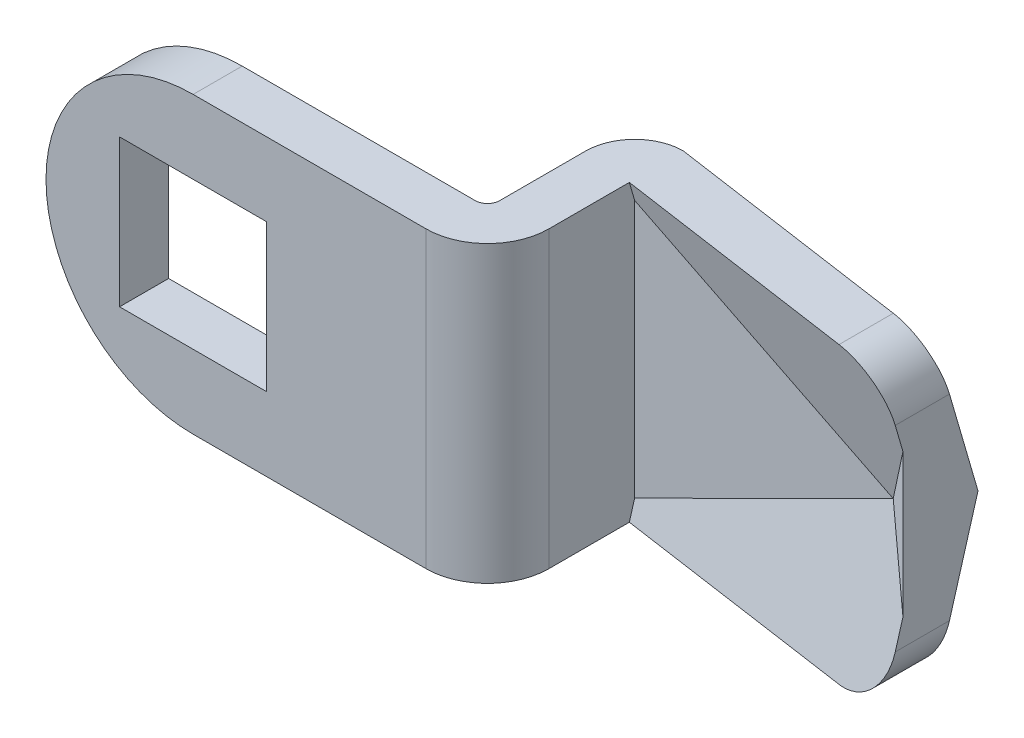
ISO-10303-21;
HEADER;
FILE_DESCRIPTION(('STEP AP214'),'2;1');
FILE_NAME('part.step','',(''),(''),'','','');
FILE_SCHEMA(('AUTOMOTIVE_DESIGN { 1 0 10303 214 1 1 1 1 }'));
ENDSEC;
DATA;
#1=APPLICATION_CONTEXT('core data for automotive mechanical design processes');
#2=APPLICATION_PROTOCOL_DEFINITION('international standard','automotive_design',2000,#1);
#3=PRODUCT_CONTEXT('',#1,'mechanical');
#4=PRODUCT('Part','Part','',(#3));
#5=PRODUCT_RELATED_PRODUCT_CATEGORY('part','',(#4));
#6=PRODUCT_DEFINITION_FORMATION('','',#4);
#7=PRODUCT_DEFINITION_CONTEXT('part definition',#1,'design');
#8=PRODUCT_DEFINITION('design','',#6,#7);
#9=PRODUCT_DEFINITION_SHAPE('','',#8);
#10=(LENGTH_UNIT() NAMED_UNIT(*) SI_UNIT(.MILLI.,.METRE.));
#11=(NAMED_UNIT(*) PLANE_ANGLE_UNIT() SI_UNIT($,.RADIAN.));
#12=(NAMED_UNIT(*) SI_UNIT($,.STERADIAN.) SOLID_ANGLE_UNIT());
#13=UNCERTAINTY_MEASURE_WITH_UNIT(LENGTH_MEASURE(1.E-05),#10,'distance_accuracy_value','');
#14=(GEOMETRIC_REPRESENTATION_CONTEXT(3) GLOBAL_UNCERTAINTY_ASSIGNED_CONTEXT((#13)) GLOBAL_UNIT_ASSIGNED_CONTEXT((#10,
#11,#12)) REPRESENTATION_CONTEXT('',''));
#15=CARTESIAN_POINT('',(0.,0.,0.));
#16=DIRECTION('',(0.,0.,1.));
#17=DIRECTION('',(1.,0.,0.));
#18=AXIS2_PLACEMENT_3D('',#15,#16,#17);
#19=CARTESIAN_POINT('',(12.,6.,-4.));
#20=DIRECTION('',(0.,1.,0.));
#21=DIRECTION('',(1.,0.,0.));
#22=AXIS2_PLACEMENT_3D('',#19,#20,#21);
#23=PLANE('',#22);
#24=DIRECTION('',(1.,0.,0.));
#25=VECTOR('',#24,1.);
#26=CARTESIAN_POINT('',(-6.,6.,0.));
#27=LINE('',#26,#25);
#28=CARTESIAN_POINT('',(0.,6.,0.));
#29=VERTEX_POINT('',#28);
#30=CARTESIAN_POINT('',(9.5,6.,0.));
#31=VERTEX_POINT('',#30);
#32=EDGE_CURVE('E440',#29,#31,#27,.T.);
#33=ORIENTED_EDGE('',*,*,#32,.F.);
#34=DIRECTION('',(0.,0.,-1.));
#35=VECTOR('',#34,1.);
#36=CARTESIAN_POINT('',(0.,6.,2.));
#37=LINE('',#36,#35);
#38=CARTESIAN_POINT('',(0.,6.,2.));
#39=VERTEX_POINT('',#38);
#40=EDGE_CURVE('E28',#39,#29,#37,.T.);
#41=ORIENTED_EDGE('',*,*,#40,.F.);
#42=DIRECTION('',(1.,0.,0.));
#43=VECTOR('',#42,1.);
#44=CARTESIAN_POINT('',(-6.,6.,2.));
#45=LINE('',#44,#43);
#46=CARTESIAN_POINT('',(9.5,6.,2.));
#47=VERTEX_POINT('',#46);
#48=EDGE_CURVE('E442',#39,#47,#45,.T.);
#49=ORIENTED_EDGE('',*,*,#48,.T.);
#50=CARTESIAN_POINT('',(9.5,6.,-0.5));
#51=DIRECTION('',(0.,-1.,0.));
#52=DIRECTION('',(-1.,0.,0.));
#53=AXIS2_PLACEMENT_3D('',#50,#51,#52);
#54=CIRCLE('',#53,2.5);
#55=CARTESIAN_POINT('',(12.,6.,-0.5));
#56=VERTEX_POINT('',#55);
#57=EDGE_CURVE('E444',#56,#47,#54,.T.);
#58=ORIENTED_EDGE('',*,*,#57,.F.);
#59=DIRECTION('',(0.,0.,-1.));
#60=VECTOR('',#59,1.);
#61=CARTESIAN_POINT('',(12.,6.,-0.5));
#62=LINE('',#61,#60);
#63=CARTESIAN_POINT('',(12.,6.,-3.78390507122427));
#64=VERTEX_POINT('',#63);
#65=EDGE_CURVE('E279',#56,#64,#62,.T.);
#66=ORIENTED_EDGE('',*,*,#65,.T.);
#67=DIRECTION('',(0.989653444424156,0.,0.143478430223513));
#68=VECTOR('',#67,1.);
#69=CARTESIAN_POINT('',(23.4568654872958,6.,-2.12290638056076));
#70=LINE('',#69,#68);
#71=CARTESIAN_POINT('',(22.,6.,-2.33412049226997));
#72=VERTEX_POINT('',#71);
#73=EDGE_CURVE('E270',#64,#72,#70,.T.);
#74=ORIENTED_EDGE('',*,*,#73,.T.);
#75=DIRECTION('',(0.,0.,-1.));
#76=VECTOR('',#75,1.);
#77=CARTESIAN_POINT('',(22.,6.,-4.));
#78=LINE('',#77,#76);
#79=CARTESIAN_POINT('',(22.,6.,-4.54526611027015));
#80=VERTEX_POINT('',#79);
#81=EDGE_CURVE('E262',#72,#80,#78,.T.);
#82=ORIENTED_EDGE('',*,*,#81,.T.);
#83=DIRECTION('',(-0.989653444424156,0.,-0.143478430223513));
#84=VECTOR('',#83,1.);
#85=CARTESIAN_POINT('',(35.2398141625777,6.,-2.62577827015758));
#86=LINE('',#85,#84);
#87=CARTESIAN_POINT('',(12.0084862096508,6.,-5.99382037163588));
#88=VERTEX_POINT('',#87);
#89=EDGE_CURVE('E249',#80,#88,#86,.T.);
#90=ORIENTED_EDGE('',*,*,#89,.T.);
#91=CARTESIAN_POINT('',(12.0084862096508,6.,-5.99382037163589));
#92=CARTESIAN_POINT('',(12.0013536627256,6.,-5.99485456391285));
#93=CARTESIAN_POINT('',(11.9942174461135,6.,-5.99586204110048));
#94=CARTESIAN_POINT('',(11.9799376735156,6.,-5.99782356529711));
#95=CARTESIAN_POINT('',(11.9727941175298,6.,-5.9987776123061));
#96=CARTESIAN_POINT('',(11.9656468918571,6.,-5.99970494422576));
#97=B_SPLINE_CURVE_WITH_KNOTS('',3,(#91,#92,#93,#94,#95,#96),.UNSPECIFIED.,.F.,.F.,(4,2,4),(0.,
0.0216209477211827,0.0432418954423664),.UNSPECIFIED.);
#98=CARTESIAN_POINT('',(11.9656468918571,6.,-5.99970494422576));
#99=VERTEX_POINT('',#98);
#100=EDGE_CURVE('E280',#88,#99,#97,.T.);
#101=ORIENTED_EDGE('',*,*,#100,.T.);
#102=CARTESIAN_POINT('',(12.,6.,-4.));
#103=DIRECTION('',(0.,1.,0.));
#104=DIRECTION('',(1.,0.,0.));
#105=AXIS2_PLACEMENT_3D('',#102,#103,#104);
#106=CIRCLE('',#105,2.);
#107=CARTESIAN_POINT('',(10.,6.,-4.));
#108=VERTEX_POINT('',#107);
#109=EDGE_CURVE('E413',#99,#108,#106,.T.);
#110=ORIENTED_EDGE('',*,*,#109,.T.);
#111=DIRECTION('',(0.,0.,-1.));
#112=VECTOR('',#111,1.);
#113=CARTESIAN_POINT('',(10.,6.,-0.5));
#114=LINE('',#113,#112);
#115=CARTESIAN_POINT('',(10.,6.,-0.5));
#116=VERTEX_POINT('',#115);
#117=EDGE_CURVE('E434',#116,#108,#114,.T.);
#118=ORIENTED_EDGE('',*,*,#117,.F.);
#119=CARTESIAN_POINT('',(9.5,6.,-0.5));
#120=DIRECTION('',(0.,-1.,0.));
#121=DIRECTION('',(-1.,0.,0.));
#122=AXIS2_PLACEMENT_3D('',#119,#120,#121);
#123=CIRCLE('',#122,0.5);
#124=EDGE_CURVE('E437',#116,#31,#123,.T.);
#125=ORIENTED_EDGE('',*,*,#124,.T.);
#126=EDGE_LOOP('',(#33,#41,#49,#58,#66,#74,#82,#90,#101,#110,#118,#125));
#127=FACE_BOUND('',#126,.T.);
#128=ADVANCED_FACE('F14',(#127),#23,.T.);
#129=CARTESIAN_POINT('',(12.,-6.,-4.));
#130=DIRECTION('',(0.,1.,0.));
#131=DIRECTION('',(1.,0.,0.));
#132=AXIS2_PLACEMENT_3D('',#129,#130,#131);
#133=PLANE('',#132);
#134=DIRECTION('',(0.,0.,-1.));
#135=VECTOR('',#134,1.);
#136=CARTESIAN_POINT('',(0.,-6.,2.));
#137=LINE('',#136,#135);
#138=CARTESIAN_POINT('',(0.,-6.,2.));
#139=VERTEX_POINT('',#138);
#140=CARTESIAN_POINT('',(0.,-6.,0.));
#141=VERTEX_POINT('',#140);
#142=EDGE_CURVE('E198',#139,#141,#137,.T.);
#143=ORIENTED_EDGE('',*,*,#142,.T.);
#144=DIRECTION('',(1.,0.,0.));
#145=VECTOR('',#144,1.);
#146=CARTESIAN_POINT('',(-6.,-6.,0.));
#147=LINE('',#146,#145);
#148=CARTESIAN_POINT('',(9.5,-6.,0.));
#149=VERTEX_POINT('',#148);
#150=EDGE_CURVE('E207',#141,#149,#147,.T.);
#151=ORIENTED_EDGE('',*,*,#150,.T.);
#152=CARTESIAN_POINT('',(9.5,-6.,-0.5));
#153=DIRECTION('',(0.,-1.,0.));
#154=DIRECTION('',(-1.,0.,0.));
#155=AXIS2_PLACEMENT_3D('',#152,#153,#154);
#156=CIRCLE('',#155,0.5);
#157=CARTESIAN_POINT('',(10.,-6.,-0.5));
#158=VERTEX_POINT('',#157);
#159=EDGE_CURVE('E217',#158,#149,#156,.T.);
#160=ORIENTED_EDGE('',*,*,#159,.F.);
#161=DIRECTION('',(0.,0.,-1.));
#162=VECTOR('',#161,1.);
#163=CARTESIAN_POINT('',(10.,-6.,-0.5));
#164=LINE('',#163,#162);
#165=CARTESIAN_POINT('',(10.,-6.,-4.));
#166=VERTEX_POINT('',#165);
#167=EDGE_CURVE('E221',#158,#166,#164,.T.);
#168=ORIENTED_EDGE('',*,*,#167,.T.);
#169=CARTESIAN_POINT('',(12.,-6.,-4.));
#170=DIRECTION('',(0.,1.,0.));
#171=DIRECTION('',(1.,0.,0.));
#172=AXIS2_PLACEMENT_3D('',#169,#170,#171);
#173=CIRCLE('',#172,2.);
#174=CARTESIAN_POINT('',(11.9656468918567,-6.,-5.99970494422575));
#175=VERTEX_POINT('',#174);
#176=EDGE_CURVE('E448',#175,#166,#173,.T.);
#177=ORIENTED_EDGE('',*,*,#176,.F.);
#178=CARTESIAN_POINT('',(12.0084862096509,-6.,-5.99382037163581));
#179=CARTESIAN_POINT('',(12.0013536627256,-6.,-5.99485456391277));
#180=CARTESIAN_POINT('',(11.9942174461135,-6.,-5.99586204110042));
#181=CARTESIAN_POINT('',(11.9799376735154,-6.,-5.99782356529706));
#182=CARTESIAN_POINT('',(11.9727941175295,-6.,-5.99877761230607));
#183=CARTESIAN_POINT('',(11.9656468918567,-6.,-5.99970494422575));
#184=B_SPLINE_CURVE_WITH_KNOTS('',3,(#178,#179,#180,#181,#182,#183),.UNSPECIFIED.,.F.,.F.,(4,2,
4),(0.,0.0216209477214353,0.0432418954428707),.UNSPECIFIED.);
#185=CARTESIAN_POINT('',(12.0084862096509,-6.,-5.99382037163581));
#186=VERTEX_POINT('',#185);
#187=EDGE_CURVE('E377',#186,#175,#184,.T.);
#188=ORIENTED_EDGE('',*,*,#187,.F.);
#189=DIRECTION('',(-0.989653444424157,0.,-0.14347843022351));
#190=VECTOR('',#189,1.);
#191=CARTESIAN_POINT('',(23.4868468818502,-6.,-4.32970534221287));
#192=LINE('',#191,#190);
#193=CARTESIAN_POINT('',(22.,-6.,-4.54526611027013));
#194=VERTEX_POINT('',#193);
#195=EDGE_CURVE('E385',#194,#186,#192,.T.);
#196=ORIENTED_EDGE('',*,*,#195,.F.);
#197=DIRECTION('',(0.,0.,1.));
#198=VECTOR('',#197,1.);
#199=CARTESIAN_POINT('',(22.,-6.,-4.));
#200=LINE('',#199,#198);
#201=CARTESIAN_POINT('',(22.,-6.,-2.33412049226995));
#202=VERTEX_POINT('',#201);
#203=EDGE_CURVE('E251',#194,#202,#200,.T.);
#204=ORIENTED_EDGE('',*,*,#203,.T.);
#205=DIRECTION('',(0.989653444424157,0.,0.143478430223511));
#206=VECTOR('',#205,1.);
#207=CARTESIAN_POINT('',(23.4568654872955,-6.,-2.12290638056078));
#208=LINE('',#207,#206);
#209=CARTESIAN_POINT('',(12.,-6.,-3.7839050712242));
#210=VERTEX_POINT('',#209);
#211=EDGE_CURVE('E281',#210,#202,#208,.T.);
#212=ORIENTED_EDGE('',*,*,#211,.F.);
#213=DIRECTION('',(0.,0.,-1.));
#214=VECTOR('',#213,1.);
#215=CARTESIAN_POINT('',(12.,-6.,-0.5));
#216=LINE('',#215,#214);
#217=CARTESIAN_POINT('',(12.,-6.,-0.5));
#218=VERTEX_POINT('',#217);
#219=EDGE_CURVE('E226',#218,#210,#216,.T.);
#220=ORIENTED_EDGE('',*,*,#219,.F.);
#221=CARTESIAN_POINT('',(9.5,-6.,-0.5));
#222=DIRECTION('',(0.,-1.,0.));
#223=DIRECTION('',(-1.,0.,0.));
#224=AXIS2_PLACEMENT_3D('',#221,#222,#223);
#225=CIRCLE('',#224,2.5);
#226=CARTESIAN_POINT('',(9.5,-6.,2.));
#227=VERTEX_POINT('',#226);
#228=EDGE_CURVE('E219',#218,#227,#225,.T.);
#229=ORIENTED_EDGE('',*,*,#228,.T.);
#230=DIRECTION('',(1.,0.,0.));
#231=VECTOR('',#230,1.);
#232=CARTESIAN_POINT('',(-6.,-6.,2.));
#233=LINE('',#232,#231);
#234=EDGE_CURVE('E210',#139,#227,#233,.T.);
#235=ORIENTED_EDGE('',*,*,#234,.F.);
#236=EDGE_LOOP('',(#143,#151,#160,#168,#177,#188,#196,#204,#212,#220,#229,#235));
#237=FACE_BOUND('',#236,.T.);
#238=ADVANCED_FACE('F205',(#237),#133,.F.);
#239=CARTESIAN_POINT('',(-6.,-6.,2.));
#240=DIRECTION('',(0.,0.,1.));
#241=DIRECTION('',(-1.,0.,0.));
#242=AXIS2_PLACEMENT_3D('',#239,#240,#241);
#243=PLANE('',#242);
#244=DIRECTION('',(0.,-1.,0.));
#245=VECTOR('',#244,1.);
#246=CARTESIAN_POINT('',(-3.,-6.,2.));
#247=LINE('',#246,#245);
#248=CARTESIAN_POINT('',(-3.,3.,2.));
#249=VERTEX_POINT('',#248);
#250=CARTESIAN_POINT('',(-3.,-3.,2.));
#251=VERTEX_POINT('',#250);
#252=EDGE_CURVE('E474',#249,#251,#247,.T.);
#253=ORIENTED_EDGE('',*,*,#252,.F.);
#254=DIRECTION('',(1.,0.,0.));
#255=VECTOR('',#254,1.);
#256=CARTESIAN_POINT('',(-6.,3.,2.));
#257=LINE('',#256,#255);
#258=CARTESIAN_POINT('',(3.,3.,2.));
#259=VERTEX_POINT('',#258);
#260=EDGE_CURVE('E568',#249,#259,#257,.T.);
#261=ORIENTED_EDGE('',*,*,#260,.T.);
#262=DIRECTION('',(0.,1.,0.));
#263=VECTOR('',#262,1.);
#264=CARTESIAN_POINT('',(3.,-6.,2.));
#265=LINE('',#264,#263);
#266=CARTESIAN_POINT('',(3.,-3.,2.));
#267=VERTEX_POINT('',#266);
#268=EDGE_CURVE('E571',#267,#259,#265,.T.);
#269=ORIENTED_EDGE('',*,*,#268,.F.);
#270=DIRECTION('',(-1.,0.,0.));
#271=VECTOR('',#270,1.);
#272=CARTESIAN_POINT('',(-6.,-3.,2.));
#273=LINE('',#272,#271);
#274=EDGE_CURVE('E574',#267,#251,#273,.T.);
#275=ORIENTED_EDGE('',*,*,#274,.T.);
#276=EDGE_LOOP('',(#253,#261,#269,#275));
#277=FACE_BOUND('',#276,.T.);
#278=ORIENTED_EDGE('',*,*,#48,.F.);
#279=CARTESIAN_POINT('',(0.,0.,2.));
#280=DIRECTION('',(0.,0.,-1.));
#281=DIRECTION('',(1.,0.,0.));
#282=AXIS2_PLACEMENT_3D('',#279,#280,#281);
#283=CIRCLE('',#282,6.);
#284=EDGE_CURVE('E211',#139,#39,#283,.T.);
#285=ORIENTED_EDGE('',*,*,#284,.F.);
#286=ORIENTED_EDGE('',*,*,#234,.T.);
#287=DIRECTION('',(0.,1.,0.));
#288=VECTOR('',#287,1.);
#289=CARTESIAN_POINT('',(9.5,-6.,2.));
#290=LINE('',#289,#288);
#291=EDGE_CURVE('E241',#227,#47,#290,.T.);
#292=ORIENTED_EDGE('',*,*,#291,.T.);
#293=EDGE_LOOP('',(#278,#285,#286,#292));
#294=FACE_BOUND('',#293,.T.);
#295=ADVANCED_FACE('F303',(#277,#294),#243,.T.);
#296=CARTESIAN_POINT('',(-6.,-6.,0.));
#297=DIRECTION('',(0.,0.,1.));
#298=DIRECTION('',(-1.,0.,0.));
#299=AXIS2_PLACEMENT_3D('',#296,#297,#298);
#300=PLANE('',#299);
#301=DIRECTION('',(-1.,0.,0.));
#302=VECTOR('',#301,1.);
#303=CARTESIAN_POINT('',(3.,3.,0.));
#304=LINE('',#303,#302);
#305=CARTESIAN_POINT('',(3.,3.,0.));
#306=VERTEX_POINT('',#305);
#307=CARTESIAN_POINT('',(-3.,3.,0.));
#308=VERTEX_POINT('',#307);
#309=EDGE_CURVE('E550',#306,#308,#304,.T.);
#310=ORIENTED_EDGE('',*,*,#309,.T.);
#311=DIRECTION('',(0.,1.,0.));
#312=VECTOR('',#311,1.);
#313=CARTESIAN_POINT('',(-3.,-3.,0.));
#314=LINE('',#313,#312);
#315=CARTESIAN_POINT('',(-3.,-3.,0.));
#316=VERTEX_POINT('',#315);
#317=EDGE_CURVE('E548',#316,#308,#314,.T.);
#318=ORIENTED_EDGE('',*,*,#317,.F.);
#319=DIRECTION('',(1.,0.,0.));
#320=VECTOR('',#319,1.);
#321=CARTESIAN_POINT('',(-3.,-3.,0.));
#322=LINE('',#321,#320);
#323=CARTESIAN_POINT('',(3.,-3.,0.));
#324=VERTEX_POINT('',#323);
#325=EDGE_CURVE('E556',#316,#324,#322,.T.);
#326=ORIENTED_EDGE('',*,*,#325,.T.);
#327=DIRECTION('',(0.,-1.,0.));
#328=VECTOR('',#327,1.);
#329=CARTESIAN_POINT('',(3.,3.,0.));
#330=LINE('',#329,#328);
#331=EDGE_CURVE('E553',#306,#324,#330,.T.);
#332=ORIENTED_EDGE('',*,*,#331,.F.);
#333=EDGE_LOOP('',(#310,#318,#326,#332));
#334=FACE_BOUND('',#333,.T.);
#335=ORIENTED_EDGE('',*,*,#150,.F.);
#336=CARTESIAN_POINT('',(0.,0.,0.));
#337=DIRECTION('',(0.,0.,1.));
#338=DIRECTION('',(-1.,0.,0.));
#339=AXIS2_PLACEMENT_3D('',#336,#337,#338);
#340=CIRCLE('',#339,6.);
#341=EDGE_CURVE('E9',#29,#141,#340,.T.);
#342=ORIENTED_EDGE('',*,*,#341,.F.);
#343=ORIENTED_EDGE('',*,*,#32,.T.);
#344=DIRECTION('',(0.,1.,0.));
#345=VECTOR('',#344,1.);
#346=CARTESIAN_POINT('',(9.5,-6.,0.));
#347=LINE('',#346,#345);
#348=CARTESIAN_POINT('',(9.5,2.85,0.));
#349=VERTEX_POINT('',#348);
#350=EDGE_CURVE('E239',#349,#31,#347,.T.);
#351=ORIENTED_EDGE('',*,*,#350,.F.);
#352=DIRECTION('',(1.,0.,0.));
#353=VECTOR('',#352,1.);
#354=CARTESIAN_POINT('',(5.,2.85,0.));
#355=LINE('',#354,#353);
#356=CARTESIAN_POINT('',(5.,2.85,0.));
#357=VERTEX_POINT('',#356);
#358=EDGE_CURVE('E514',#357,#349,#355,.T.);
#359=ORIENTED_EDGE('',*,*,#358,.F.);
#360=DIRECTION('',(0.,1.,0.));
#361=VECTOR('',#360,1.);
#362=CARTESIAN_POINT('',(5.,-2.85,0.));
#363=LINE('',#362,#361);
#364=CARTESIAN_POINT('',(5.,-2.85,0.));
#365=VERTEX_POINT('',#364);
#366=EDGE_CURVE('E541',#365,#357,#363,.T.);
#367=ORIENTED_EDGE('',*,*,#366,.F.);
#368=DIRECTION('',(1.,0.,0.));
#369=VECTOR('',#368,1.);
#370=CARTESIAN_POINT('',(5.,-2.85,0.));
#371=LINE('',#370,#369);
#372=CARTESIAN_POINT('',(9.5,-2.85,0.));
#373=VERTEX_POINT('',#372);
#374=EDGE_CURVE('E529',#365,#373,#371,.T.);
#375=ORIENTED_EDGE('',*,*,#374,.T.);
#376=EDGE_CURVE('E215',#149,#373,#347,.T.);
#377=ORIENTED_EDGE('',*,*,#376,.F.);
#378=EDGE_LOOP('',(#335,#342,#343,#351,#359,#367,#375,#377));
#379=FACE_BOUND('',#378,.T.);
#380=ADVANCED_FACE('F213',(#334,#379),#300,.F.);
#381=CARTESIAN_POINT('',(9.5,-6.,-0.5));
#382=DIRECTION('',(0.,1.,0.));
#383=DIRECTION('',(1.,0.,0.));
#384=AXIS2_PLACEMENT_3D('',#381,#382,#383);
#385=CYLINDRICAL_SURFACE('',#384,0.5);
#386=DIRECTION('',(0.,1.,0.));
#387=VECTOR('',#386,1.);
#388=CARTESIAN_POINT('',(10.,-6.,-0.5));
#389=LINE('',#388,#387);
#390=CARTESIAN_POINT('',(10.,2.85,-0.5));
#391=VERTEX_POINT('',#390);
#392=EDGE_CURVE('E235',#391,#116,#389,.T.);
#393=ORIENTED_EDGE('',*,*,#392,.F.);
#394=CARTESIAN_POINT('',(9.5,2.85,-0.5));
#395=DIRECTION('',(0.,-1.,0.));
#396=DIRECTION('',(-1.,0.,0.));
#397=AXIS2_PLACEMENT_3D('',#394,#395,#396);
#398=CIRCLE('',#397,0.5);
#399=EDGE_CURVE('E504',#391,#349,#398,.T.);
#400=ORIENTED_EDGE('',*,*,#399,.T.);
#401=ORIENTED_EDGE('',*,*,#350,.T.);
#402=ORIENTED_EDGE('',*,*,#124,.F.);
#403=EDGE_LOOP('',(#393,#400,#401,#402));
#404=FACE_BOUND('',#403,.T.);
#405=ADVANCED_FACE('F328',(#404),#385,.F.);
#406=CARTESIAN_POINT('',(22.6089834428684,26.535177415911,3.7254248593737));
#407=DIRECTION('',(0.13788270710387,0.27654992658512,-0.951056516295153));
#408=DIRECTION('',(0.,-0.960228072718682,-0.279216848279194));
#409=AXIS2_PLACEMENT_3D('',#406,#407,#408);
#410=PLANE('',#409);
#411=DIRECTION('',(0.,-0.960228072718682,-0.279216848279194));
#412=VECTOR('',#411,1.);
#413=CARTESIAN_POINT('',(24.,26.4811079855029,3.91136988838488));
#414=LINE('',#413,#412);
#415=CARTESIAN_POINT('',(24.,4.,-2.62572717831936));
#416=VERTEX_POINT('',#415);
#417=CARTESIAN_POINT('',(24.,2.92107254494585,-2.93945964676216));
#418=VERTEX_POINT('',#417);
#419=EDGE_CURVE('E273',#416,#418,#414,.T.);
#420=ORIENTED_EDGE('',*,*,#419,.F.);
#421=CARTESIAN_POINT('',(22.,4.,-2.91568409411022));
#422=DIRECTION('',(0.13788270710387,0.27654992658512,-0.951056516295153));
#423=DIRECTION('',(-0.424359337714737,-0.851133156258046,-0.309016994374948));
#424=AXIS2_PLACEMENT_3D('',#421,#422,#423);
#425=ELLIPSE('',#424,2.10292444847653,2.);
#426=EDGE_CURVE('E22',#416,#72,#425,.F.);
#427=ORIENTED_EDGE('',*,*,#426,.T.);
#428=ORIENTED_EDGE('',*,*,#73,.F.);
#429=DIRECTION('',(0.,0.960228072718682,0.279216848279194));
#430=VECTOR('',#429,1.);
#431=CARTESIAN_POINT('',(12.,-4.18400153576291,-6.74522737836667));
#432=LINE('',#431,#430);
#433=CARTESIAN_POINT('',(12.,5.25684850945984,-4.));
#434=VERTEX_POINT('',#433);
#435=EDGE_CURVE('E348',#434,#64,#432,.T.);
#436=ORIENTED_EDGE('',*,*,#435,.F.);
#437=DIRECTION('',(-0.894934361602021,0.446197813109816,0.));
#438=VECTOR('',#437,1.);
#439=CARTESIAN_POINT('',(23.7100430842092,-0.581563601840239,-4.));
#440=LINE('',#439,#438);
#441=CARTESIAN_POINT('',(22.5436069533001,0.,-4.));
#442=VERTEX_POINT('',#441);
#443=EDGE_CURVE('E355',#442,#434,#440,.T.);
#444=ORIENTED_EDGE('',*,*,#443,.F.);
#445=DIRECTION('',(-0.424359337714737,-0.851133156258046,-0.309016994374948));
#446=VECTOR('',#445,1.);
#447=CARTESIAN_POINT('',(33.1525903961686,21.2783289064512,3.72542485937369));
#448=LINE('',#447,#446);
#449=EDGE_CURVE('E357',#418,#442,#448,.T.);
#450=ORIENTED_EDGE('',*,*,#449,.F.);
#451=EDGE_LOOP('',(#420,#427,#428,#436,#444,#450));
#452=FACE_BOUND('',#451,.T.);
#453=ADVANCED_FACE('F268',(#452),#410,.F.);
#454=CARTESIAN_POINT('',(34.6089834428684,21.2783289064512,1.72542485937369));
#455=DIRECTION('',(-0.13788270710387,-0.27654992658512,0.951056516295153));
#456=DIRECTION('',(0.,0.960228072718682,0.279216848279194));
#457=AXIS2_PLACEMENT_3D('',#454,#455,#456);
#458=PLANE('',#457);
#459=ORIENTED_EDGE('',*,*,#89,.F.);
#460=CARTESIAN_POINT('',(22.,4.,-5.12682971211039));
#461=DIRECTION('',(-0.13788270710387,-0.27654992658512,0.951056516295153));
#462=DIRECTION('',(-0.424359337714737,-0.851133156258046,-0.309016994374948));
#463=AXIS2_PLACEMENT_3D('',#460,#461,#462);
#464=ELLIPSE('',#463,2.10292444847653,2.);
#465=CARTESIAN_POINT('',(24.,4.,-4.83687279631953));
#466=VERTEX_POINT('',#465);
#467=EDGE_CURVE('E36',#80,#466,#464,.F.);
#468=ORIENTED_EDGE('',*,*,#467,.T.);
#469=DIRECTION('',(0.,0.960228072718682,0.279216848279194));
#470=VECTOR('',#469,1.);
#471=CARTESIAN_POINT('',(24.,21.6907047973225,0.307262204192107));
#472=LINE('',#471,#470);
#473=CARTESIAN_POINT('',(24.,0.,-6.));
#474=VERTEX_POINT('',#473);
#475=EDGE_CURVE('E425',#474,#466,#472,.T.);
#476=ORIENTED_EDGE('',*,*,#475,.F.);
#477=DIRECTION('',(-0.894934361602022,0.446197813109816,0.));
#478=VECTOR('',#477,1.);
#479=CARTESIAN_POINT('',(24.,0.,-6.));
#480=LINE('',#479,#478);
#481=CARTESIAN_POINT('',(12.,5.9829792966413,-6.));
#482=VERTEX_POINT('',#481);
#483=EDGE_CURVE('E419',#474,#482,#480,.T.);
#484=ORIENTED_EDGE('',*,*,#483,.T.);
#485=DIRECTION('',(-0.424359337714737,-0.851133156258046,-0.309016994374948));
#486=VECTOR('',#485,1.);
#487=CARTESIAN_POINT('',(22.6089834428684,27.2613082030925,1.7254248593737));
#488=LINE('',#487,#486);
#489=EDGE_CURVE('E362',#88,#482,#488,.T.);
#490=ORIENTED_EDGE('',*,*,#489,.F.);
#491=EDGE_LOOP('',(#459,#468,#476,#484,#490));
#492=FACE_BOUND('',#491,.T.);
#493=ADVANCED_FACE('F423',(#492),#458,.F.);
#494=CARTESIAN_POINT('',(22.6089834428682,-26.5351774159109,3.7254248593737));
#495=DIRECTION('',(0.137882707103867,-0.276549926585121,-0.951056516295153));
#496=DIRECTION('',(0.,-0.960228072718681,0.279216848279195));
#497=AXIS2_PLACEMENT_3D('',#494,#495,#496);
#498=PLANE('',#497);
#499=ORIENTED_EDGE('',*,*,#211,.T.);
#500=CARTESIAN_POINT('',(22.,-4.,-2.91568409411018));
#501=DIRECTION('',(0.137882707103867,-0.276549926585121,-0.951056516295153));
#502=DIRECTION('',(-0.424359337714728,0.85113315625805,-0.309016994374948));
#503=AXIS2_PLACEMENT_3D('',#500,#501,#502);
#504=ELLIPSE('',#503,2.10292444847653,2.);
#505=CARTESIAN_POINT('',(24.,-4.,-2.62572717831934));
#506=VERTEX_POINT('',#505);
#507=EDGE_CURVE('E254',#202,#506,#504,.F.);
#508=ORIENTED_EDGE('',*,*,#507,.T.);
#509=DIRECTION('',(0.,-0.960228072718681,0.279216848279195));
#510=VECTOR('',#509,1.);
#511=CARTESIAN_POINT('',(24.,-26.4811079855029,3.91136988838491));
#512=LINE('',#511,#510);
#513=CARTESIAN_POINT('',(24.,-2.92107254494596,-2.93945964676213));
#514=VERTEX_POINT('',#513);
#515=EDGE_CURVE('E466',#514,#506,#512,.T.);
#516=ORIENTED_EDGE('',*,*,#515,.F.);
#517=DIRECTION('',(-0.424359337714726,0.851133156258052,-0.309016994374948));
#518=VECTOR('',#517,1.);
#519=CARTESIAN_POINT('',(33.1525903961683,-21.2783289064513,3.7254248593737));
#520=LINE('',#519,#518);
#521=EDGE_CURVE('E356',#514,#442,#520,.T.);
#522=ORIENTED_EDGE('',*,*,#521,.T.);
#523=DIRECTION('',(0.894934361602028,0.446197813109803,0.));
#524=VECTOR('',#523,1.);
#525=CARTESIAN_POINT('',(23.7100430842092,0.581563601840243,-4.));
#526=LINE('',#525,#524);
#527=CARTESIAN_POINT('',(12.,-5.25684850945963,-4.));
#528=VERTEX_POINT('',#527);
#529=EDGE_CURVE('E415',#442,#528,#526,.F.);
#530=ORIENTED_EDGE('',*,*,#529,.T.);
#531=DIRECTION('',(0.,0.960228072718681,-0.279216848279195));
#532=VECTOR('',#531,1.);
#533=CARTESIAN_POINT('',(12.,-6.88045388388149,-3.52788510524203));
#534=LINE('',#533,#532);
#535=EDGE_CURVE('E350',#210,#528,#534,.T.);
#536=ORIENTED_EDGE('',*,*,#535,.F.);
#537=EDGE_LOOP('',(#499,#508,#516,#522,#530,#536));
#538=FACE_BOUND('',#537,.T.);
#539=ADVANCED_FACE('F375',(#538),#498,.F.);
#540=CARTESIAN_POINT('',(22.6089834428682,-27.2613082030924,1.7254248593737));
#541=DIRECTION('',(-0.137882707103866,0.276549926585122,0.951056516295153));
#542=DIRECTION('',(0.,0.960228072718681,-0.279216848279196));
#543=AXIS2_PLACEMENT_3D('',#540,#541,#542);
#544=PLANE('',#543);
#545=DIRECTION('',(0.,0.960228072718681,-0.279216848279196));
#546=VECTOR('',#545,1.);
#547=CARTESIAN_POINT('',(24.,-27.2072387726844,1.91136988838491));
#548=LINE('',#547,#546);
#549=CARTESIAN_POINT('',(24.,-4.,-4.83687279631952));
#550=VERTEX_POINT('',#549);
#551=EDGE_CURVE('E386',#550,#474,#548,.T.);
#552=ORIENTED_EDGE('',*,*,#551,.F.);
#553=CARTESIAN_POINT('',(22.,-4.,-5.12682971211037));
#554=DIRECTION('',(-0.137882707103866,0.276549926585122,0.951056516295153));
#555=DIRECTION('',(-0.424359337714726,0.851133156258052,-0.309016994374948));
#556=AXIS2_PLACEMENT_3D('',#553,#554,#555);
#557=ELLIPSE('',#556,2.10292444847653,2.);
#558=EDGE_CURVE('E260',#550,#194,#557,.F.);
#559=ORIENTED_EDGE('',*,*,#558,.T.);
#560=ORIENTED_EDGE('',*,*,#195,.T.);
#561=DIRECTION('',(-0.424359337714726,0.851133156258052,-0.309016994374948));
#562=VECTOR('',#561,1.);
#563=CARTESIAN_POINT('',(22.6089834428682,-27.2613082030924,1.7254248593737));
#564=LINE('',#563,#562);
#565=CARTESIAN_POINT('',(12.,-5.98297929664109,-6.));
#566=VERTEX_POINT('',#565);
#567=EDGE_CURVE('E359',#186,#566,#564,.T.);
#568=ORIENTED_EDGE('',*,*,#567,.T.);
#569=DIRECTION('',(-0.894934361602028,-0.446197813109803,0.));
#570=VECTOR('',#569,1.);
#571=CARTESIAN_POINT('',(24.,0.,-6.));
#572=LINE('',#571,#570);
#573=EDGE_CURVE('E421',#474,#566,#572,.T.);
#574=ORIENTED_EDGE('',*,*,#573,.F.);
#575=EDGE_LOOP('',(#552,#559,#560,#568,#574));
#576=FACE_BOUND('',#575,.T.);
#577=ADVANCED_FACE('F306',(#576),#544,.F.);
#578=CARTESIAN_POINT('',(29.4240032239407,5.24949855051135,1.01028064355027));
#579=DIRECTION('',(0.588660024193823,0.,-0.808380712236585));
#580=DIRECTION('',(0.808380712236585,0.,0.588660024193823));
#581=AXIS2_PLACEMENT_3D('',#578,#579,#580);
#582=PLANE('',#581);
#583=DIRECTION('',(0.,-1.,0.));
#584=VECTOR('',#583,1.);
#585=CARTESIAN_POINT('',(24.,5.24949855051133,-2.93945964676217));
#586=LINE('',#585,#584);
#587=EDGE_CURVE('E471',#418,#514,#586,.T.);
#588=ORIENTED_EDGE('',*,*,#587,.F.);
#589=ORIENTED_EDGE('',*,*,#449,.T.);
#590=ORIENTED_EDGE('',*,*,#521,.F.);
#591=EDGE_LOOP('',(#588,#589,#590));
#592=FACE_BOUND('',#591,.T.);
#593=ADVANCED_FACE('F344',(#592),#582,.F.);
#594=CARTESIAN_POINT('',(22.6089834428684,26.535177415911,3.7254248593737));
#595=DIRECTION('',(0.424359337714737,0.851133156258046,0.309016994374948));
#596=DIRECTION('',(-0.688039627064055,0.524949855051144,-0.501028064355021));
#597=AXIS2_PLACEMENT_3D('',#594,#595,#596);
#598=ELLIPSE('',#597,2.34980858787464,2.);
#599=DIRECTION('',(-0.424359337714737,-0.851133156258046,-0.309016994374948));
#600=VECTOR('',#599,1.);
#601=SURFACE_OF_LINEAR_EXTRUSION('',#598,#600);
#602=ORIENTED_EDGE('',*,*,#100,.F.);
#603=ORIENTED_EDGE('',*,*,#489,.T.);
#604=CARTESIAN_POINT('',(12.,5.25684850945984,-4.));
#605=DIRECTION('',(-0.424359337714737,-0.851133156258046,-0.309016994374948));
#606=DIRECTION('',(-0.688039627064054,0.524949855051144,-0.501028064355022));
#607=AXIS2_PLACEMENT_3D('',#604,#605,#606);
#608=ELLIPSE('',#607,2.34980858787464,2.);
#609=EDGE_CURVE('E406',#482,#99,#608,.F.);
#610=ORIENTED_EDGE('',*,*,#609,.T.);
#611=EDGE_LOOP('',(#602,#603,#610));
#612=FACE_BOUND('',#611,.T.);
#613=ADVANCED_FACE('F338',(#612),#601,.F.);
#614=CARTESIAN_POINT('',(12.,-6.,-0.5));
#615=DIRECTION('',(1.,0.,0.));
#616=DIRECTION('',(0.,0.,1.));
#617=AXIS2_PLACEMENT_3D('',#614,#615,#616);
#618=PLANE('',#617);
#619=DIRECTION('',(0.,1.,0.));
#620=VECTOR('',#619,1.);
#621=CARTESIAN_POINT('',(12.,-6.,-4.));
#622=LINE('',#621,#620);
#623=EDGE_CURVE('E246',#528,#434,#622,.T.);
#624=ORIENTED_EDGE('',*,*,#623,.T.);
#625=ORIENTED_EDGE('',*,*,#435,.T.);
#626=ORIENTED_EDGE('',*,*,#65,.F.);
#627=DIRECTION('',(0.,1.,0.));
#628=VECTOR('',#627,1.);
#629=CARTESIAN_POINT('',(12.,-6.,-0.5));
#630=LINE('',#629,#628);
#631=EDGE_CURVE('E244',#218,#56,#630,.T.);
#632=ORIENTED_EDGE('',*,*,#631,.F.);
#633=ORIENTED_EDGE('',*,*,#219,.T.);
#634=ORIENTED_EDGE('',*,*,#535,.T.);
#635=EDGE_LOOP('',(#624,#625,#626,#632,#633,#634));
#636=FACE_BOUND('',#635,.T.);
#637=ADVANCED_FACE('F316',(#636),#618,.T.);
#638=CARTESIAN_POINT('',(12.,-6.,-4.));
#639=DIRECTION('',(0.,1.,0.));
#640=DIRECTION('',(1.,0.,0.));
#641=AXIS2_PLACEMENT_3D('',#638,#639,#640);
#642=CYLINDRICAL_SURFACE('',#641,2.);
#643=ORIENTED_EDGE('',*,*,#609,.F.);
#644=DIRECTION('',(0.,1.,0.));
#645=VECTOR('',#644,1.);
#646=CARTESIAN_POINT('',(12.,-6.,-6.));
#647=LINE('',#646,#645);
#648=EDGE_CURVE('E229',#566,#482,#647,.T.);
#649=ORIENTED_EDGE('',*,*,#648,.F.);
#650=CARTESIAN_POINT('',(12.,-5.25684850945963,-4.));
#651=DIRECTION('',(-0.424359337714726,0.851133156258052,-0.309016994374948));
#652=DIRECTION('',(0.688039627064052,0.524949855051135,0.501028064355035));
#653=AXIS2_PLACEMENT_3D('',#650,#651,#652);
#654=ELLIPSE('',#653,2.34980858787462,2.);
#655=EDGE_CURVE('E414',#566,#175,#654,.T.);
#656=ORIENTED_EDGE('',*,*,#655,.T.);
#657=ORIENTED_EDGE('',*,*,#176,.T.);
#658=DIRECTION('',(0.,1.,0.));
#659=VECTOR('',#658,1.);
#660=CARTESIAN_POINT('',(10.,-6.,-4.));
#661=LINE('',#660,#659);
#662=EDGE_CURVE('E232',#166,#108,#661,.T.);
#663=ORIENTED_EDGE('',*,*,#662,.T.);
#664=ORIENTED_EDGE('',*,*,#109,.F.);
#665=EDGE_LOOP('',(#643,#649,#656,#657,#663,#664));
#666=FACE_BOUND('',#665,.T.);
#667=ADVANCED_FACE('F312',(#666),#642,.T.);
#668=CARTESIAN_POINT('',(12.,-6.,-6.));
#669=DIRECTION('',(0.,0.,1.));
#670=DIRECTION('',(-1.,0.,0.));
#671=AXIS2_PLACEMENT_3D('',#668,#669,#670);
#672=PLANE('',#671);
#673=ORIENTED_EDGE('',*,*,#648,.T.);
#674=ORIENTED_EDGE('',*,*,#483,.F.);
#675=ORIENTED_EDGE('',*,*,#573,.T.);
#676=EDGE_LOOP('',(#673,#674,#675));
#677=FACE_BOUND('',#676,.T.);
#678=ADVANCED_FACE('F309',(#677),#672,.F.);
#679=CARTESIAN_POINT('',(12.,-6.,-4.));
#680=DIRECTION('',(0.,0.,1.));
#681=DIRECTION('',(-1.,0.,0.));
#682=AXIS2_PLACEMENT_3D('',#679,#680,#681);
#683=PLANE('',#682);
#684=ORIENTED_EDGE('',*,*,#443,.T.);
#685=ORIENTED_EDGE('',*,*,#623,.F.);
#686=ORIENTED_EDGE('',*,*,#529,.F.);
#687=EDGE_LOOP('',(#684,#685,#686));
#688=FACE_BOUND('',#687,.T.);
#689=ADVANCED_FACE('F16',(#688),#683,.T.);
#690=CARTESIAN_POINT('',(9.5,-6.,-0.5));
#691=DIRECTION('',(0.,1.,0.));
#692=DIRECTION('',(1.,0.,0.));
#693=AXIS2_PLACEMENT_3D('',#690,#691,#692);
#694=CYLINDRICAL_SURFACE('',#693,2.5);
#695=ORIENTED_EDGE('',*,*,#291,.F.);
#696=ORIENTED_EDGE('',*,*,#228,.F.);
#697=ORIENTED_EDGE('',*,*,#631,.T.);
#698=ORIENTED_EDGE('',*,*,#57,.T.);
#699=EDGE_LOOP('',(#695,#696,#697,#698));
#700=FACE_BOUND('',#699,.T.);
#701=ADVANCED_FACE('F326',(#700),#694,.T.);
#702=CARTESIAN_POINT('',(9.5,-2.85,-0.5));
#703=DIRECTION('',(0.,-1.,0.));
#704=DIRECTION('',(-1.,0.,0.));
#705=AXIS2_PLACEMENT_3D('',#702,#703,#704);
#706=CIRCLE('',#705,0.5);
#707=CARTESIAN_POINT('',(10.,-2.85,-0.5));
#708=VERTEX_POINT('',#707);
#709=EDGE_CURVE('E531',#708,#373,#706,.T.);
#710=ORIENTED_EDGE('',*,*,#709,.F.);
#711=EDGE_CURVE('E236',#158,#708,#389,.T.);
#712=ORIENTED_EDGE('',*,*,#711,.F.);
#713=ORIENTED_EDGE('',*,*,#159,.T.);
#714=ORIENTED_EDGE('',*,*,#376,.T.);
#715=EDGE_LOOP('',(#710,#712,#713,#714));
#716=FACE_BOUND('',#715,.T.);
#717=ADVANCED_FACE('F322',(#716),#385,.F.);
#718=CARTESIAN_POINT('',(10.,-6.,-0.5));
#719=DIRECTION('',(1.,0.,0.));
#720=DIRECTION('',(0.,0.,1.));
#721=AXIS2_PLACEMENT_3D('',#718,#719,#720);
#722=PLANE('',#721);
#723=ORIENTED_EDGE('',*,*,#711,.T.);
#724=DIRECTION('',(0.,0.,-1.));
#725=VECTOR('',#724,1.);
#726=CARTESIAN_POINT('',(10.,-2.85,-0.5));
#727=LINE('',#726,#725);
#728=CARTESIAN_POINT('',(10.,-2.85,-0.82166181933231));
#729=VERTEX_POINT('',#728);
#730=EDGE_CURVE('E534',#708,#729,#727,.T.);
#731=ORIENTED_EDGE('',*,*,#730,.T.);
#732=DIRECTION('',(0.,1.,0.));
#733=VECTOR('',#732,1.);
#734=CARTESIAN_POINT('',(10.,-2.85,-0.82166181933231));
#735=LINE('',#734,#733);
#736=CARTESIAN_POINT('',(10.,2.85,-0.82166181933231));
#737=VERTEX_POINT('',#736);
#738=EDGE_CURVE('E544',#729,#737,#735,.T.);
#739=ORIENTED_EDGE('',*,*,#738,.T.);
#740=DIRECTION('',(0.,0.,-1.));
#741=VECTOR('',#740,1.);
#742=CARTESIAN_POINT('',(10.,2.85,-0.5));
#743=LINE('',#742,#741);
#744=EDGE_CURVE('E511',#391,#737,#743,.T.);
#745=ORIENTED_EDGE('',*,*,#744,.F.);
#746=ORIENTED_EDGE('',*,*,#392,.T.);
#747=ORIENTED_EDGE('',*,*,#117,.T.);
#748=ORIENTED_EDGE('',*,*,#662,.F.);
#749=ORIENTED_EDGE('',*,*,#167,.F.);
#750=EDGE_LOOP('',(#723,#731,#739,#745,#746,#747,#748,#749));
#751=FACE_BOUND('',#750,.T.);
#752=ADVANCED_FACE('F318',(#751),#722,.F.);
#753=CARTESIAN_POINT('',(22.6089834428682,-26.5351774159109,3.7254248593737));
#754=DIRECTION('',(0.424359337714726,-0.851133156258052,0.309016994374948));
#755=DIRECTION('',(0.688039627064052,0.524949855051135,0.501028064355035));
#756=AXIS2_PLACEMENT_3D('',#753,#754,#755);
#757=ELLIPSE('',#756,2.34980858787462,2.);
#758=DIRECTION('',(-0.424359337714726,0.851133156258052,-0.309016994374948));
#759=VECTOR('',#758,1.);
#760=SURFACE_OF_LINEAR_EXTRUSION('',#757,#759);
#761=ORIENTED_EDGE('',*,*,#567,.F.);
#762=ORIENTED_EDGE('',*,*,#187,.T.);
#763=ORIENTED_EDGE('',*,*,#655,.F.);
#764=EDGE_LOOP('',(#761,#762,#763));
#765=FACE_BOUND('',#764,.T.);
#766=ADVANCED_FACE('F321',(#765),#760,.F.);
#767=CARTESIAN_POINT('',(24.,44.,-18.3074169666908));
#768=DIRECTION('',(1.,0.,0.));
#769=DIRECTION('',(0.,-1.,0.));
#770=AXIS2_PLACEMENT_3D('',#767,#768,#769);
#771=PLANE('',#770);
#772=ORIENTED_EDGE('',*,*,#515,.T.);
#773=DIRECTION('',(0.,0.,1.));
#774=VECTOR('',#773,1.);
#775=CARTESIAN_POINT('',(24.,-4.,-4.));
#776=LINE('',#775,#774);
#777=EDGE_CURVE('E258',#506,#550,#776,.F.);
#778=ORIENTED_EDGE('',*,*,#777,.T.);
#779=ORIENTED_EDGE('',*,*,#551,.T.);
#780=ORIENTED_EDGE('',*,*,#475,.T.);
#781=DIRECTION('',(0.,0.,-1.));
#782=VECTOR('',#781,1.);
#783=CARTESIAN_POINT('',(24.,4.,-18.3074169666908));
#784=LINE('',#783,#782);
#785=EDGE_CURVE('E256',#466,#416,#784,.F.);
#786=ORIENTED_EDGE('',*,*,#785,.T.);
#787=ORIENTED_EDGE('',*,*,#419,.T.);
#788=ORIENTED_EDGE('',*,*,#587,.T.);
#789=EDGE_LOOP('',(#772,#778,#779,#780,#786,#787,#788));
#790=FACE_BOUND('',#789,.T.);
#791=ADVANCED_FACE('F372',(#790),#771,.T.);
#792=CARTESIAN_POINT('',(-3.,-3.,50.));
#793=DIRECTION('',(-1.,0.,0.));
#794=DIRECTION('',(0.,1.,0.));
#795=AXIS2_PLACEMENT_3D('',#792,#793,#794);
#796=PLANE('',#795);
#797=ORIENTED_EDGE('',*,*,#252,.T.);
#798=DIRECTION('',(0.,0.,-1.));
#799=VECTOR('',#798,1.);
#800=CARTESIAN_POINT('',(-3.,-3.,50.));
#801=LINE('',#800,#799);
#802=EDGE_CURVE('E566',#251,#316,#801,.T.);
#803=ORIENTED_EDGE('',*,*,#802,.T.);
#804=ORIENTED_EDGE('',*,*,#317,.T.);
#805=DIRECTION('',(0.,0.,-1.));
#806=VECTOR('',#805,1.);
#807=CARTESIAN_POINT('',(-3.,3.,50.));
#808=LINE('',#807,#806);
#809=EDGE_CURVE('E559',#249,#308,#808,.T.);
#810=ORIENTED_EDGE('',*,*,#809,.F.);
#811=EDGE_LOOP('',(#797,#803,#804,#810));
#812=FACE_BOUND('',#811,.T.);
#813=ADVANCED_FACE('F580',(#812),#796,.F.);
#814=CARTESIAN_POINT('',(-3.,-3.,50.));
#815=DIRECTION('',(0.,1.,0.));
#816=DIRECTION('',(1.,0.,0.));
#817=AXIS2_PLACEMENT_3D('',#814,#815,#816);
#818=PLANE('',#817);
#819=DIRECTION('',(0.,0.,-1.));
#820=VECTOR('',#819,1.);
#821=CARTESIAN_POINT('',(3.,-3.,50.));
#822=LINE('',#821,#820);
#823=EDGE_CURVE('E564',#267,#324,#822,.T.);
#824=ORIENTED_EDGE('',*,*,#823,.T.);
#825=ORIENTED_EDGE('',*,*,#325,.F.);
#826=ORIENTED_EDGE('',*,*,#802,.F.);
#827=ORIENTED_EDGE('',*,*,#274,.F.);
#828=EDGE_LOOP('',(#824,#825,#826,#827));
#829=FACE_BOUND('',#828,.T.);
#830=ADVANCED_FACE('F583',(#829),#818,.T.);
#831=CARTESIAN_POINT('',(3.,3.,50.));
#832=DIRECTION('',(1.,0.,0.));
#833=DIRECTION('',(0.,0.,1.));
#834=AXIS2_PLACEMENT_3D('',#831,#832,#833);
#835=PLANE('',#834);
#836=ORIENTED_EDGE('',*,*,#268,.T.);
#837=DIRECTION('',(0.,0.,-1.));
#838=VECTOR('',#837,1.);
#839=CARTESIAN_POINT('',(3.,3.,50.));
#840=LINE('',#839,#838);
#841=EDGE_CURVE('E562',#259,#306,#840,.T.);
#842=ORIENTED_EDGE('',*,*,#841,.T.);
#843=ORIENTED_EDGE('',*,*,#331,.T.);
#844=ORIENTED_EDGE('',*,*,#823,.F.);
#845=EDGE_LOOP('',(#836,#842,#843,#844));
#846=FACE_BOUND('',#845,.T.);
#847=ADVANCED_FACE('F589',(#846),#835,.F.);
#848=CARTESIAN_POINT('',(3.,3.,50.));
#849=DIRECTION('',(0.,-1.,0.));
#850=DIRECTION('',(-1.,0.,0.));
#851=AXIS2_PLACEMENT_3D('',#848,#849,#850);
#852=PLANE('',#851);
#853=ORIENTED_EDGE('',*,*,#809,.T.);
#854=ORIENTED_EDGE('',*,*,#309,.F.);
#855=ORIENTED_EDGE('',*,*,#841,.F.);
#856=ORIENTED_EDGE('',*,*,#260,.F.);
#857=EDGE_LOOP('',(#853,#854,#855,#856));
#858=FACE_BOUND('',#857,.T.);
#859=ADVANCED_FACE('F593',(#858),#852,.T.);
#860=CARTESIAN_POINT('',(6.8,-2.85,-1.8));
#861=DIRECTION('',(0.,0.,-1.));
#862=DIRECTION('',(1.,0.,0.));
#863=AXIS2_PLACEMENT_3D('',#860,#861,#862);
#864=PLANE('',#863);
#865=DIRECTION('',(0.,1.,0.));
#866=VECTOR('',#865,1.);
#867=CARTESIAN_POINT('',(6.8,-2.85,-1.8));
#868=LINE('',#867,#866);
#869=CARTESIAN_POINT('',(6.8,-2.85,-1.8));
#870=VERTEX_POINT('',#869);
#871=CARTESIAN_POINT('',(6.8,2.85,-1.8));
#872=VERTEX_POINT('',#871);
#873=EDGE_CURVE('E546',#870,#872,#868,.T.);
#874=ORIENTED_EDGE('',*,*,#873,.F.);
#875=DIRECTION('',(-1.,0.,0.));
#876=VECTOR('',#875,1.);
#877=CARTESIAN_POINT('',(6.8,-2.85,-1.8));
#878=LINE('',#877,#876);
#879=CARTESIAN_POINT('',(5.,-2.85,-1.8));
#880=VERTEX_POINT('',#879);
#881=EDGE_CURVE('E523',#870,#880,#878,.T.);
#882=ORIENTED_EDGE('',*,*,#881,.T.);
#883=DIRECTION('',(0.,1.,0.));
#884=VECTOR('',#883,1.);
#885=CARTESIAN_POINT('',(5.,-2.85,-1.8));
#886=LINE('',#885,#884);
#887=CARTESIAN_POINT('',(5.,2.85,-1.8));
#888=VERTEX_POINT('',#887);
#889=EDGE_CURVE('E539',#880,#888,#886,.T.);
#890=ORIENTED_EDGE('',*,*,#889,.T.);
#891=DIRECTION('',(-1.,0.,0.));
#892=VECTOR('',#891,1.);
#893=CARTESIAN_POINT('',(6.8,2.85,-1.8));
#894=LINE('',#893,#892);
#895=EDGE_CURVE('E795',#872,#888,#894,.T.);
#896=ORIENTED_EDGE('',*,*,#895,.F.);
#897=EDGE_LOOP('',(#874,#882,#890,#896));
#898=FACE_BOUND('',#897,.T.);
#899=ADVANCED_FACE('F595',(#898),#864,.T.);
#900=CARTESIAN_POINT('',(6.8,-2.85,-1.8));
#901=DIRECTION('',(-0.29237170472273,0.,0.956304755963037));
#902=DIRECTION('',(-0.956304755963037,0.,-0.29237170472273));
#903=AXIS2_PLACEMENT_3D('',#900,#901,#902);
#904=PLANE('',#903);
#905=ORIENTED_EDGE('',*,*,#738,.F.);
#906=DIRECTION('',(0.956304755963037,0.,0.29237170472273));
#907=VECTOR('',#906,1.);
#908=CARTESIAN_POINT('',(6.8,-2.85,-1.8));
#909=LINE('',#908,#907);
#910=EDGE_CURVE('E536',#870,#729,#909,.T.);
#911=ORIENTED_EDGE('',*,*,#910,.F.);
#912=ORIENTED_EDGE('',*,*,#873,.T.);
#913=DIRECTION('',(0.956304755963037,0.,0.29237170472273));
#914=VECTOR('',#913,1.);
#915=CARTESIAN_POINT('',(6.8,2.85,-1.8));
#916=LINE('',#915,#914);
#917=EDGE_CURVE('E516',#872,#737,#916,.T.);
#918=ORIENTED_EDGE('',*,*,#917,.T.);
#919=EDGE_LOOP('',(#905,#911,#912,#918));
#920=FACE_BOUND('',#919,.T.);
#921=ADVANCED_FACE('F602',(#920),#904,.F.);
#922=CARTESIAN_POINT('',(5.,-2.85,-1.8));
#923=DIRECTION('',(-1.,0.,0.));
#924=DIRECTION('',(0.,0.,-1.));
#925=AXIS2_PLACEMENT_3D('',#922,#923,#924);
#926=PLANE('',#925);
#927=DIRECTION('',(0.,0.,1.));
#928=VECTOR('',#927,1.);
#929=CARTESIAN_POINT('',(5.,-2.85,-1.8));
#930=LINE('',#929,#928);
#931=EDGE_CURVE('E526',#880,#365,#930,.T.);
#932=ORIENTED_EDGE('',*,*,#931,.T.);
#933=ORIENTED_EDGE('',*,*,#366,.T.);
#934=DIRECTION('',(0.,0.,1.));
#935=VECTOR('',#934,1.);
#936=CARTESIAN_POINT('',(5.,2.85,-1.8));
#937=LINE('',#936,#935);
#938=EDGE_CURVE('E518',#888,#357,#937,.T.);
#939=ORIENTED_EDGE('',*,*,#938,.F.);
#940=ORIENTED_EDGE('',*,*,#889,.F.);
#941=EDGE_LOOP('',(#932,#933,#939,#940));
#942=FACE_BOUND('',#941,.T.);
#943=ADVANCED_FACE('F763',(#942),#926,.T.);
#944=CARTESIAN_POINT('',(9.5,-2.85,-0.5));
#945=DIRECTION('',(0.,-1.,0.));
#946=DIRECTION('',(-1.,0.,0.));
#947=AXIS2_PLACEMENT_3D('',#944,#945,#946);
#948=PLANE('',#947);
#949=ORIENTED_EDGE('',*,*,#881,.F.);
#950=ORIENTED_EDGE('',*,*,#910,.T.);
#951=ORIENTED_EDGE('',*,*,#730,.F.);
#952=ORIENTED_EDGE('',*,*,#709,.T.);
#953=ORIENTED_EDGE('',*,*,#374,.F.);
#954=ORIENTED_EDGE('',*,*,#931,.F.);
#955=EDGE_LOOP('',(#949,#950,#951,#952,#953,#954));
#956=FACE_BOUND('',#955,.T.);
#957=ADVANCED_FACE('F761',(#956),#948,.T.);
#958=CARTESIAN_POINT('',(9.5,2.85,-0.5));
#959=DIRECTION('',(0.,-1.,0.));
#960=DIRECTION('',(-1.,0.,0.));
#961=AXIS2_PLACEMENT_3D('',#958,#959,#960);
#962=PLANE('',#961);
#963=ORIENTED_EDGE('',*,*,#895,.T.);
#964=ORIENTED_EDGE('',*,*,#938,.T.);
#965=ORIENTED_EDGE('',*,*,#358,.T.);
#966=ORIENTED_EDGE('',*,*,#399,.F.);
#967=ORIENTED_EDGE('',*,*,#744,.T.);
#968=ORIENTED_EDGE('',*,*,#917,.F.);
#969=EDGE_LOOP('',(#963,#964,#965,#966,#967,#968));
#970=FACE_BOUND('',#969,.T.);
#971=ADVANCED_FACE('F294',(#970),#962,.F.);
#972=CARTESIAN_POINT('',(22.,-4.,-4.));
#973=DIRECTION('',(0.,0.,-1.));
#974=DIRECTION('',(0.,-1.,0.));
#975=AXIS2_PLACEMENT_3D('',#972,#973,#974);
#976=CYLINDRICAL_SURFACE('',#975,2.);
#977=ORIENTED_EDGE('',*,*,#558,.F.);
#978=ORIENTED_EDGE('',*,*,#777,.F.);
#979=ORIENTED_EDGE('',*,*,#507,.F.);
#980=ORIENTED_EDGE('',*,*,#203,.F.);
#981=EDGE_LOOP('',(#977,#978,#979,#980));
#982=FACE_BOUND('',#981,.T.);
#983=ADVANCED_FACE('F285',(#982),#976,.T.);
#984=CARTESIAN_POINT('',(22.,4.,-4.));
#985=DIRECTION('',(0.,0.,-1.));
#986=DIRECTION('',(0.,-1.,0.));
#987=AXIS2_PLACEMENT_3D('',#984,#985,#986);
#988=CYLINDRICAL_SURFACE('',#987,2.);
#989=ORIENTED_EDGE('',*,*,#426,.F.);
#990=ORIENTED_EDGE('',*,*,#785,.F.);
#991=ORIENTED_EDGE('',*,*,#467,.F.);
#992=ORIENTED_EDGE('',*,*,#81,.F.);
#993=EDGE_LOOP('',(#989,#990,#991,#992));
#994=FACE_BOUND('',#993,.T.);
#995=ADVANCED_FACE('F283',(#994),#988,.T.);
#996=CARTESIAN_POINT('',(0.,0.,2.));
#997=DIRECTION('',(0.,0.,-1.));
#998=DIRECTION('',(1.,0.,0.));
#999=AXIS2_PLACEMENT_3D('',#996,#997,#998);
#1000=CYLINDRICAL_SURFACE('',#999,6.);
#1001=ORIENTED_EDGE('',*,*,#284,.T.);
#1002=ORIENTED_EDGE('',*,*,#40,.T.);
#1003=ORIENTED_EDGE('',*,*,#341,.T.);
#1004=ORIENTED_EDGE('',*,*,#142,.F.);
#1005=EDGE_LOOP('',(#1001,#1002,#1003,#1004));
#1006=FACE_BOUND('',#1005,.T.);
#1007=ADVANCED_FACE('F197',(#1006),#1000,.T.);
#1008=CLOSED_SHELL('',(#128,#238,#295,#380,#405,#453,#493,#539,#577,#593,#613,#637,#667,#678,
#689,#701,#717,#752,#766,#791,#813,#830,#847,#859,#899,#921,#943,#957,#971,#983,#995,#1007));
#1009=MANIFOLD_SOLID_BREP('B1',#1008);
#1010=ADVANCED_BREP_SHAPE_REPRESENTATION('',(#18,#1009),#14);
#1011=SHAPE_DEFINITION_REPRESENTATION(#9,#1010);
ENDSEC;
END-ISO-10303-21;
